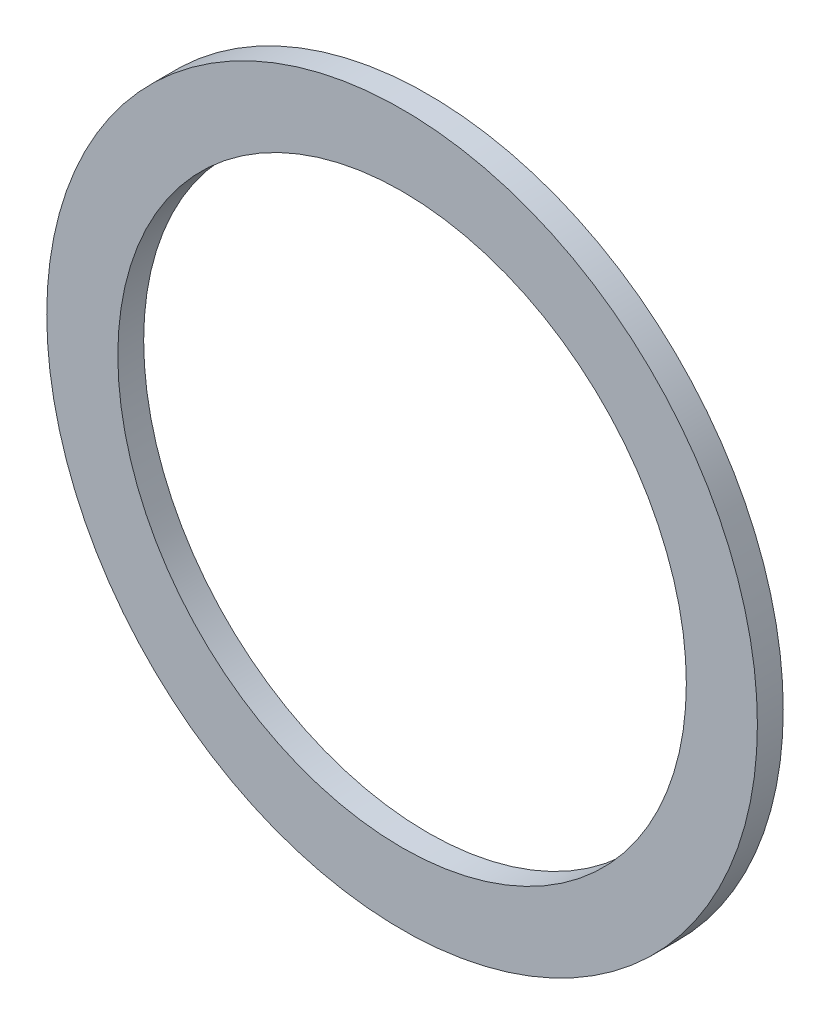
ISO-10303-21;
HEADER;
FILE_DESCRIPTION(('STEP AP214'),'2;1');
FILE_NAME('part.step','',(''),(''),'','','');
FILE_SCHEMA(('AUTOMOTIVE_DESIGN { 1 0 10303 214 1 1 1 1 }'));
ENDSEC;
DATA;
#1=APPLICATION_CONTEXT('core data for automotive mechanical design processes');
#2=APPLICATION_PROTOCOL_DEFINITION('international standard','automotive_design',2000,#1);
#3=PRODUCT_CONTEXT('',#1,'mechanical');
#4=PRODUCT('Part','Part','',(#3));
#5=PRODUCT_RELATED_PRODUCT_CATEGORY('part','',(#4));
#6=PRODUCT_DEFINITION_FORMATION('','',#4);
#7=PRODUCT_DEFINITION_CONTEXT('part definition',#1,'design');
#8=PRODUCT_DEFINITION('design','',#6,#7);
#9=PRODUCT_DEFINITION_SHAPE('','',#8);
#10=(LENGTH_UNIT() NAMED_UNIT(*) SI_UNIT(.MILLI.,.METRE.));
#11=(NAMED_UNIT(*) PLANE_ANGLE_UNIT() SI_UNIT($,.RADIAN.));
#12=(NAMED_UNIT(*) SI_UNIT($,.STERADIAN.) SOLID_ANGLE_UNIT());
#13=UNCERTAINTY_MEASURE_WITH_UNIT(LENGTH_MEASURE(1.E-05),#10,'distance_accuracy_value','');
#14=(GEOMETRIC_REPRESENTATION_CONTEXT(3) GLOBAL_UNCERTAINTY_ASSIGNED_CONTEXT((#13)) GLOBAL_UNIT_ASSIGNED_CONTEXT((#10,
#11,#12)) REPRESENTATION_CONTEXT('',''));
#15=CARTESIAN_POINT('',(0.,0.,0.));
#16=DIRECTION('',(0.,0.,1.));
#17=DIRECTION('',(1.,0.,0.));
#18=AXIS2_PLACEMENT_3D('',#15,#16,#17);
#19=CARTESIAN_POINT('',(0.,0.,0.));
#20=DIRECTION('',(0.,0.,1.));
#21=DIRECTION('',(1.,0.,0.));
#22=AXIS2_PLACEMENT_3D('',#19,#20,#21);
#23=PLANE('',#22);
#24=CARTESIAN_POINT('',(0.,0.,0.));
#25=DIRECTION('',(0.,0.,-1.));
#26=DIRECTION('',(-1.,0.,0.));
#27=AXIS2_PLACEMENT_3D('',#24,#25,#26);
#28=CIRCLE('',#27,13.75);
#29=CARTESIAN_POINT('',(-13.75,0.,0.));
#30=VERTEX_POINT('',#29);
#31=EDGE_CURVE('E26',#30,#30,#28,.F.);
#32=ORIENTED_EDGE('',*,*,#31,.F.);
#33=EDGE_LOOP('',(#32));
#34=FACE_BOUND('',#33,.T.);
#35=CARTESIAN_POINT('',(0.,0.,0.));
#36=DIRECTION('',(0.,0.,-1.));
#37=DIRECTION('',(-1.,0.,0.));
#38=AXIS2_PLACEMENT_3D('',#35,#36,#37);
#39=CIRCLE('',#38,11.);
#40=CARTESIAN_POINT('',(-11.,0.,0.));
#41=VERTEX_POINT('',#40);
#42=EDGE_CURVE('E17',#41,#41,#39,.F.);
#43=ORIENTED_EDGE('',*,*,#42,.T.);
#44=EDGE_LOOP('',(#43));
#45=FACE_BOUND('',#44,.T.);
#46=ADVANCED_FACE('F14',(#34,#45),#23,.F.);
#47=CARTESIAN_POINT('',(0.,0.,1.));
#48=DIRECTION('',(0.,0.,-1.));
#49=DIRECTION('',(-1.,0.,0.));
#50=AXIS2_PLACEMENT_3D('',#47,#48,#49);
#51=CYLINDRICAL_SURFACE('',#50,11.);
#52=ORIENTED_EDGE('',*,*,#42,.F.);
#53=EDGE_LOOP('',(#52));
#54=FACE_BOUND('',#53,.T.);
#55=CARTESIAN_POINT('',(0.,0.,1.));
#56=DIRECTION('',(0.,0.,-1.));
#57=DIRECTION('',(-1.,0.,0.));
#58=AXIS2_PLACEMENT_3D('',#55,#56,#57);
#59=CIRCLE('',#58,11.);
#60=CARTESIAN_POINT('',(-11.,0.,1.));
#61=VERTEX_POINT('',#60);
#62=EDGE_CURVE('E21',#61,#61,#59,.T.);
#63=ORIENTED_EDGE('',*,*,#62,.F.);
#64=EDGE_LOOP('',(#63));
#65=FACE_BOUND('',#64,.T.);
#66=ADVANCED_FACE('F35',(#54,#65),#51,.F.);
#67=CARTESIAN_POINT('',(0.,0.,1.));
#68=DIRECTION('',(0.,0.,-1.));
#69=DIRECTION('',(-1.,0.,0.));
#70=AXIS2_PLACEMENT_3D('',#67,#68,#69);
#71=CYLINDRICAL_SURFACE('',#70,13.75);
#72=ORIENTED_EDGE('',*,*,#31,.T.);
#73=EDGE_LOOP('',(#72));
#74=FACE_BOUND('',#73,.T.);
#75=CARTESIAN_POINT('',(0.,0.,1.));
#76=DIRECTION('',(0.,0.,-1.));
#77=DIRECTION('',(-1.,0.,0.));
#78=AXIS2_PLACEMENT_3D('',#75,#76,#77);
#79=CIRCLE('',#78,13.75);
#80=CARTESIAN_POINT('',(-13.75,0.,1.));
#81=VERTEX_POINT('',#80);
#82=EDGE_CURVE('E10',#81,#81,#79,.F.);
#83=ORIENTED_EDGE('',*,*,#82,.F.);
#84=EDGE_LOOP('',(#83));
#85=FACE_BOUND('',#84,.T.);
#86=ADVANCED_FACE('F38',(#74,#85),#71,.T.);
#87=CARTESIAN_POINT('',(0.,0.,1.));
#88=DIRECTION('',(0.,0.,1.));
#89=DIRECTION('',(1.,0.,0.));
#90=AXIS2_PLACEMENT_3D('',#87,#88,#89);
#91=PLANE('',#90);
#92=ORIENTED_EDGE('',*,*,#82,.T.);
#93=EDGE_LOOP('',(#92));
#94=FACE_BOUND('',#93,.T.);
#95=ORIENTED_EDGE('',*,*,#62,.T.);
#96=EDGE_LOOP('',(#95));
#97=FACE_BOUND('',#96,.T.);
#98=ADVANCED_FACE('F41',(#94,#97),#91,.T.);
#99=CLOSED_SHELL('',(#46,#66,#86,#98));
#100=MANIFOLD_SOLID_BREP('B1',#99);
#101=ADVANCED_BREP_SHAPE_REPRESENTATION('',(#18,#100),#14);
#102=SHAPE_DEFINITION_REPRESENTATION(#9,#101);
ENDSEC;
END-ISO-10303-21;
